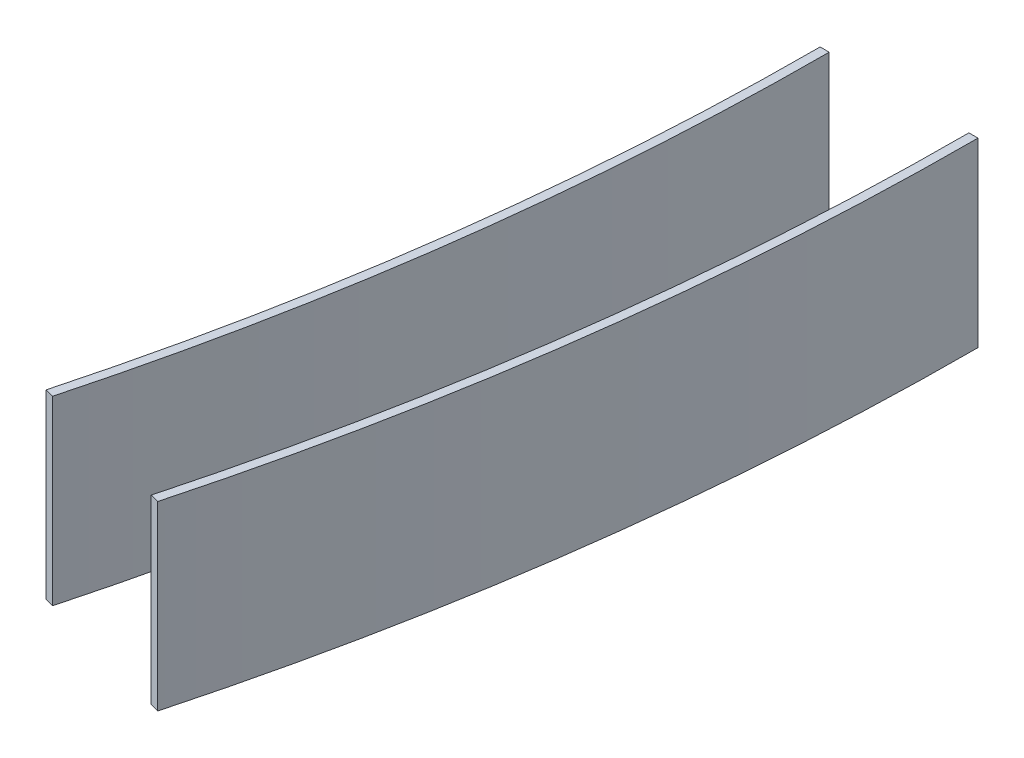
ISO-10303-21;
HEADER;
FILE_DESCRIPTION(('STEP AP214'),'2;1');
FILE_NAME('part.step','',(''),(''),'','','');
FILE_SCHEMA(('AUTOMOTIVE_DESIGN { 1 0 10303 214 1 1 1 1 }'));
ENDSEC;
DATA;
#1=APPLICATION_CONTEXT('core data for automotive mechanical design processes');
#2=APPLICATION_PROTOCOL_DEFINITION('international standard','automotive_design',2000,#1);
#3=PRODUCT_CONTEXT('',#1,'mechanical');
#4=PRODUCT('Part','Part','',(#3));
#5=PRODUCT_RELATED_PRODUCT_CATEGORY('part','',(#4));
#6=PRODUCT_DEFINITION_FORMATION('','',#4);
#7=PRODUCT_DEFINITION_CONTEXT('part definition',#1,'design');
#8=PRODUCT_DEFINITION('design','',#6,#7);
#9=PRODUCT_DEFINITION_SHAPE('','',#8);
#10=(LENGTH_UNIT() NAMED_UNIT(*) SI_UNIT(.MILLI.,.METRE.));
#11=(NAMED_UNIT(*) PLANE_ANGLE_UNIT() SI_UNIT($,.RADIAN.));
#12=(NAMED_UNIT(*) SI_UNIT($,.STERADIAN.) SOLID_ANGLE_UNIT());
#13=UNCERTAINTY_MEASURE_WITH_UNIT(LENGTH_MEASURE(1.E-05),#10,'distance_accuracy_value','');
#14=(GEOMETRIC_REPRESENTATION_CONTEXT(3) GLOBAL_UNCERTAINTY_ASSIGNED_CONTEXT((#13)) GLOBAL_UNIT_ASSIGNED_CONTEXT((#10,
#11,#12)) REPRESENTATION_CONTEXT('',''));
#15=CARTESIAN_POINT('',(0.,0.,0.));
#16=DIRECTION('',(0.,0.,1.));
#17=DIRECTION('',(1.,0.,0.));
#18=AXIS2_PLACEMENT_3D('',#15,#16,#17);
#19=CARTESIAN_POINT('',(0.,-9.74999999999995,0.));
#20=DIRECTION('',(0.,-1.,0.));
#21=DIRECTION('',(0.,0.,-1.));
#22=AXIS2_PLACEMENT_3D('',#19,#20,#21);
#23=PLANE('',#22);
#24=CARTESIAN_POINT('',(0.,-9.74999999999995,0.));
#25=DIRECTION('',(0.,1.,0.));
#26=DIRECTION('',(0.,0.,1.));
#27=AXIS2_PLACEMENT_3D('',#24,#25,#26);
#28=CIRCLE('',#27,154.35);
#29=CARTESIAN_POINT('',(149.090651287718,-9.74999999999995,39.9487196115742));
#30=VERTEX_POINT('',#29);
#31=CARTESIAN_POINT('',(154.35,-9.74999999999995,0.));
#32=VERTEX_POINT('',#31);
#33=EDGE_CURVE('E12',#30,#32,#28,.T.);
#34=ORIENTED_EDGE('',*,*,#33,.F.);
#35=DIRECTION('',(-0.965925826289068,0.,-0.258819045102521));
#36=VECTOR('',#35,1.);
#37=CARTESIAN_POINT('',(0.,-9.74999999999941,0.));
#38=LINE('',#37,#36);
#39=CARTESIAN_POINT('',(148.607688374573,-9.74999999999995,39.8193100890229));
#40=VERTEX_POINT('',#39);
#41=EDGE_CURVE('E108',#30,#40,#38,.T.);
#42=ORIENTED_EDGE('',*,*,#41,.T.);
#43=CARTESIAN_POINT('',(0.,-9.74999999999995,0.));
#44=DIRECTION('',(0.,1.,0.));
#45=DIRECTION('',(0.,0.,1.));
#46=AXIS2_PLACEMENT_3D('',#43,#44,#45);
#47=CIRCLE('',#46,153.85);
#48=CARTESIAN_POINT('',(153.85,-9.74999999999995,0.));
#49=VERTEX_POINT('',#48);
#50=EDGE_CURVE('E61',#40,#49,#47,.T.);
#51=ORIENTED_EDGE('',*,*,#50,.T.);
#52=DIRECTION('',(-1.,0.,0.));
#53=VECTOR('',#52,1.);
#54=CARTESIAN_POINT('',(0.,-9.74999999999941,0.));
#55=LINE('',#54,#53);
#56=EDGE_CURVE('E97',#32,#49,#55,.T.);
#57=ORIENTED_EDGE('',*,*,#56,.F.);
#58=EDGE_LOOP('',(#34,#42,#51,#57));
#59=FACE_BOUND('',#58,.T.);
#60=ADVANCED_FACE('F46',(#59),#23,.T.);
#61=CARTESIAN_POINT('',(0.,44.1101666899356,0.));
#62=DIRECTION('',(0.,1.,0.));
#63=DIRECTION('',(0.,0.,1.));
#64=AXIS2_PLACEMENT_3D('',#61,#62,#63);
#65=CYLINDRICAL_SURFACE('',#64,154.35);
#66=CARTESIAN_POINT('',(0.,0.250000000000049,0.));
#67=DIRECTION('',(0.,1.,0.));
#68=DIRECTION('',(0.,0.,1.));
#69=AXIS2_PLACEMENT_3D('',#66,#67,#68);
#70=CIRCLE('',#69,154.35);
#71=CARTESIAN_POINT('',(149.090651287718,0.250000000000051,39.9487196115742));
#72=VERTEX_POINT('',#71);
#73=CARTESIAN_POINT('',(154.35,0.250000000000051,0.));
#74=VERTEX_POINT('',#73);
#75=EDGE_CURVE('E54',#72,#74,#70,.T.);
#76=ORIENTED_EDGE('',*,*,#75,.F.);
#77=DIRECTION('',(0.,1.,0.));
#78=VECTOR('',#77,1.);
#79=CARTESIAN_POINT('',(149.090651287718,0.,39.9487196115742));
#80=LINE('',#79,#78);
#81=EDGE_CURVE('E93',#30,#72,#80,.T.);
#82=ORIENTED_EDGE('',*,*,#81,.F.);
#83=ORIENTED_EDGE('',*,*,#33,.T.);
#84=DIRECTION('',(0.,1.,0.));
#85=VECTOR('',#84,1.);
#86=CARTESIAN_POINT('',(154.35,0.,0.));
#87=LINE('',#86,#85);
#88=EDGE_CURVE('E90',#32,#74,#87,.T.);
#89=ORIENTED_EDGE('',*,*,#88,.T.);
#90=EDGE_LOOP('',(#76,#82,#83,#89));
#91=FACE_BOUND('',#90,.T.);
#92=ADVANCED_FACE('F48',(#91),#65,.T.);
#93=CARTESIAN_POINT('',(0.,0.250000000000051,0.));
#94=DIRECTION('',(0.,1.,0.));
#95=DIRECTION('',(0.,0.,1.));
#96=AXIS2_PLACEMENT_3D('',#93,#94,#95);
#97=PLANE('',#96);
#98=CARTESIAN_POINT('',(0.,0.250000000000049,0.));
#99=DIRECTION('',(0.,1.,0.));
#100=DIRECTION('',(0.,0.,1.));
#101=AXIS2_PLACEMENT_3D('',#98,#99,#100);
#102=CIRCLE('',#101,153.85);
#103=CARTESIAN_POINT('',(148.607688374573,0.250000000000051,39.8193100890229));
#104=VERTEX_POINT('',#103);
#105=CARTESIAN_POINT('',(153.85,0.250000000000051,0.));
#106=VERTEX_POINT('',#105);
#107=EDGE_CURVE('E69',#104,#106,#102,.T.);
#108=ORIENTED_EDGE('',*,*,#107,.F.);
#109=DIRECTION('',(0.965925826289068,0.,0.258819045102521));
#110=VECTOR('',#109,1.);
#111=CARTESIAN_POINT('',(0.,0.250000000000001,0.));
#112=LINE('',#111,#110);
#113=EDGE_CURVE('E111',#104,#72,#112,.T.);
#114=ORIENTED_EDGE('',*,*,#113,.T.);
#115=ORIENTED_EDGE('',*,*,#75,.T.);
#116=DIRECTION('',(1.,0.,0.));
#117=VECTOR('',#116,1.);
#118=CARTESIAN_POINT('',(0.,0.250000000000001,0.));
#119=LINE('',#118,#117);
#120=EDGE_CURVE('E102',#106,#74,#119,.T.);
#121=ORIENTED_EDGE('',*,*,#120,.F.);
#122=EDGE_LOOP('',(#108,#114,#115,#121));
#123=FACE_BOUND('',#122,.T.);
#124=ADVANCED_FACE('F117',(#123),#97,.T.);
#125=CARTESIAN_POINT('',(0.,44.1101666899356,0.));
#126=DIRECTION('',(0.,1.,0.));
#127=DIRECTION('',(0.,0.,1.));
#128=AXIS2_PLACEMENT_3D('',#125,#126,#127);
#129=CYLINDRICAL_SURFACE('',#128,153.85);
#130=DIRECTION('',(0.,-1.,0.));
#131=VECTOR('',#130,1.);
#132=CARTESIAN_POINT('',(148.607688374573,4.27019530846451E-13,39.8193100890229));
#133=LINE('',#132,#131);
#134=EDGE_CURVE('E113',#104,#40,#133,.T.);
#135=ORIENTED_EDGE('',*,*,#134,.F.);
#136=ORIENTED_EDGE('',*,*,#107,.T.);
#137=DIRECTION('',(0.,-1.,0.));
#138=VECTOR('',#137,1.);
#139=CARTESIAN_POINT('',(153.85,4.27019530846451E-13,0.));
#140=LINE('',#139,#138);
#141=EDGE_CURVE('E104',#106,#49,#140,.T.);
#142=ORIENTED_EDGE('',*,*,#141,.T.);
#143=ORIENTED_EDGE('',*,*,#50,.F.);
#144=EDGE_LOOP('',(#135,#136,#142,#143));
#145=FACE_BOUND('',#144,.T.);
#146=ADVANCED_FACE('F120',(#145),#129,.F.);
#147=CARTESIAN_POINT('',(0.,0.,0.));
#148=DIRECTION('',(-0.258819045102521,0.,0.965925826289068));
#149=DIRECTION('',(0.965925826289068,0.,0.258819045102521));
#150=AXIS2_PLACEMENT_3D('',#147,#148,#149);
#151=PLANE('',#150);
#152=ORIENTED_EDGE('',*,*,#41,.F.);
#153=ORIENTED_EDGE('',*,*,#81,.T.);
#154=ORIENTED_EDGE('',*,*,#113,.F.);
#155=ORIENTED_EDGE('',*,*,#134,.T.);
#156=EDGE_LOOP('',(#152,#153,#154,#155));
#157=FACE_BOUND('',#156,.T.);
#158=ADVANCED_FACE('F119',(#157),#151,.T.);
#159=CARTESIAN_POINT('',(0.,0.,0.));
#160=DIRECTION('',(0.,0.,1.));
#161=DIRECTION('',(1.,0.,0.));
#162=AXIS2_PLACEMENT_3D('',#159,#160,#161);
#163=PLANE('',#162);
#164=ORIENTED_EDGE('',*,*,#56,.T.);
#165=ORIENTED_EDGE('',*,*,#141,.F.);
#166=ORIENTED_EDGE('',*,*,#120,.T.);
#167=ORIENTED_EDGE('',*,*,#88,.F.);
#168=EDGE_LOOP('',(#164,#165,#166,#167));
#169=FACE_BOUND('',#168,.T.);
#170=ADVANCED_FACE('F101',(#169),#163,.F.);
#171=CLOSED_SHELL('',(#60,#92,#124,#146,#158,#170));
#172=MANIFOLD_SOLID_BREP('B2',#171);
#173=CARTESIAN_POINT('',(0.,-9.74999999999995,0.));
#174=DIRECTION('',(0.,-1.,0.));
#175=DIRECTION('',(0.,0.,-1.));
#176=AXIS2_PLACEMENT_3D('',#173,#174,#175);
#177=PLANE('',#176);
#178=CARTESIAN_POINT('',(0.,-9.74999999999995,0.));
#179=DIRECTION('',(0.,1.,0.));
#180=DIRECTION('',(0.,0.,1.));
#181=AXIS2_PLACEMENT_3D('',#178,#179,#180);
#182=CIRCLE('',#181,146.15);
#183=CARTESIAN_POINT('',(141.170059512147,-9.74999999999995,37.8264034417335));
#184=VERTEX_POINT('',#183);
#185=CARTESIAN_POINT('',(146.15,-9.74999999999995,0.));
#186=VERTEX_POINT('',#185);
#187=EDGE_CURVE('E44',#184,#186,#182,.T.);
#188=ORIENTED_EDGE('',*,*,#187,.F.);
#189=DIRECTION('',(-0.965925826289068,0.,-0.258819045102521));
#190=VECTOR('',#189,1.);
#191=CARTESIAN_POINT('',(0.,-9.75000000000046,0.));
#192=LINE('',#191,#190);
#193=CARTESIAN_POINT('',(140.687096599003,-9.74999999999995,37.6969939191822));
#194=VERTEX_POINT('',#193);
#195=EDGE_CURVE('E234',#184,#194,#192,.T.);
#196=ORIENTED_EDGE('',*,*,#195,.T.);
#197=CARTESIAN_POINT('',(0.,-9.74999999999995,0.));
#198=DIRECTION('',(0.,1.,0.));
#199=DIRECTION('',(0.,0.,1.));
#200=AXIS2_PLACEMENT_3D('',#197,#198,#199);
#201=CIRCLE('',#200,145.65);
#202=CARTESIAN_POINT('',(145.65,-9.74999999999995,0.));
#203=VERTEX_POINT('',#202);
#204=EDGE_CURVE('E187',#194,#203,#201,.T.);
#205=ORIENTED_EDGE('',*,*,#204,.T.);
#206=DIRECTION('',(-1.,0.,0.));
#207=VECTOR('',#206,1.);
#208=CARTESIAN_POINT('',(0.,-9.75000000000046,0.));
#209=LINE('',#208,#207);
#210=EDGE_CURVE('E223',#186,#203,#209,.T.);
#211=ORIENTED_EDGE('',*,*,#210,.F.);
#212=EDGE_LOOP('',(#188,#196,#205,#211));
#213=FACE_BOUND('',#212,.T.);
#214=ADVANCED_FACE('F172',(#213),#177,.T.);
#215=CARTESIAN_POINT('',(0.,44.1101666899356,0.));
#216=DIRECTION('',(0.,1.,0.));
#217=DIRECTION('',(0.,0.,1.));
#218=AXIS2_PLACEMENT_3D('',#215,#216,#217);
#219=CYLINDRICAL_SURFACE('',#218,146.15);
#220=CARTESIAN_POINT('',(0.,0.250000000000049,0.));
#221=DIRECTION('',(0.,1.,0.));
#222=DIRECTION('',(0.,0.,1.));
#223=AXIS2_PLACEMENT_3D('',#220,#221,#222);
#224=CIRCLE('',#223,146.15);
#225=CARTESIAN_POINT('',(141.170059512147,0.25000000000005,37.8264034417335));
#226=VERTEX_POINT('',#225);
#227=CARTESIAN_POINT('',(146.15,0.25000000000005,0.));
#228=VERTEX_POINT('',#227);
#229=EDGE_CURVE('E180',#226,#228,#224,.T.);
#230=ORIENTED_EDGE('',*,*,#229,.F.);
#231=DIRECTION('',(0.,-1.,0.));
#232=VECTOR('',#231,1.);
#233=CARTESIAN_POINT('',(141.170059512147,-4.05647737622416E-13,37.8264034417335));
#234=LINE('',#233,#232);
#235=EDGE_CURVE('E219',#226,#184,#234,.T.);
#236=ORIENTED_EDGE('',*,*,#235,.T.);
#237=ORIENTED_EDGE('',*,*,#187,.T.);
#238=DIRECTION('',(0.,-1.,0.));
#239=VECTOR('',#238,1.);
#240=CARTESIAN_POINT('',(146.15,-4.05647737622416E-13,0.));
#241=LINE('',#240,#239);
#242=EDGE_CURVE('E216',#228,#186,#241,.T.);
#243=ORIENTED_EDGE('',*,*,#242,.F.);
#244=EDGE_LOOP('',(#230,#236,#237,#243));
#245=FACE_BOUND('',#244,.T.);
#246=ADVANCED_FACE('F174',(#245),#219,.T.);
#247=CARTESIAN_POINT('',(0.,0.25000000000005,0.));
#248=DIRECTION('',(0.,1.,0.));
#249=DIRECTION('',(0.,0.,1.));
#250=AXIS2_PLACEMENT_3D('',#247,#248,#249);
#251=PLANE('',#250);
#252=CARTESIAN_POINT('',(0.,0.250000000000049,0.));
#253=DIRECTION('',(0.,1.,0.));
#254=DIRECTION('',(0.,0.,1.));
#255=AXIS2_PLACEMENT_3D('',#252,#253,#254);
#256=CIRCLE('',#255,145.65);
#257=CARTESIAN_POINT('',(140.687096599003,0.25000000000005,37.6969939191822));
#258=VERTEX_POINT('',#257);
#259=CARTESIAN_POINT('',(145.65,0.25000000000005,0.));
#260=VERTEX_POINT('',#259);
#261=EDGE_CURVE('E195',#258,#260,#256,.T.);
#262=ORIENTED_EDGE('',*,*,#261,.F.);
#263=DIRECTION('',(0.965925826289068,0.,0.258819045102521));
#264=VECTOR('',#263,1.);
#265=CARTESIAN_POINT('',(0.,0.25000000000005,0.));
#266=LINE('',#265,#264);
#267=EDGE_CURVE('E237',#258,#226,#266,.T.);
#268=ORIENTED_EDGE('',*,*,#267,.T.);
#269=ORIENTED_EDGE('',*,*,#229,.T.);
#270=DIRECTION('',(1.,0.,0.));
#271=VECTOR('',#270,1.);
#272=CARTESIAN_POINT('',(0.,0.25000000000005,0.));
#273=LINE('',#272,#271);
#274=EDGE_CURVE('E228',#260,#228,#273,.T.);
#275=ORIENTED_EDGE('',*,*,#274,.F.);
#276=EDGE_LOOP('',(#262,#268,#269,#275));
#277=FACE_BOUND('',#276,.T.);
#278=ADVANCED_FACE('F243',(#277),#251,.T.);
#279=CARTESIAN_POINT('',(0.,44.1101666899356,0.));
#280=DIRECTION('',(0.,1.,0.));
#281=DIRECTION('',(0.,0.,1.));
#282=AXIS2_PLACEMENT_3D('',#279,#280,#281);
#283=CYLINDRICAL_SURFACE('',#282,145.65);
#284=DIRECTION('',(0.,-1.,0.));
#285=VECTOR('',#284,1.);
#286=CARTESIAN_POINT('',(140.687096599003,0.,37.6969939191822));
#287=LINE('',#286,#285);
#288=EDGE_CURVE('E239',#258,#194,#287,.T.);
#289=ORIENTED_EDGE('',*,*,#288,.F.);
#290=ORIENTED_EDGE('',*,*,#261,.T.);
#291=DIRECTION('',(0.,-1.,0.));
#292=VECTOR('',#291,1.);
#293=CARTESIAN_POINT('',(145.65,0.,0.));
#294=LINE('',#293,#292);
#295=EDGE_CURVE('E230',#260,#203,#294,.T.);
#296=ORIENTED_EDGE('',*,*,#295,.T.);
#297=ORIENTED_EDGE('',*,*,#204,.F.);
#298=EDGE_LOOP('',(#289,#290,#296,#297));
#299=FACE_BOUND('',#298,.T.);
#300=ADVANCED_FACE('F246',(#299),#283,.F.);
#301=CARTESIAN_POINT('',(0.,0.,0.));
#302=DIRECTION('',(-0.258819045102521,0.,0.965925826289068));
#303=DIRECTION('',(0.965925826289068,0.,0.258819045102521));
#304=AXIS2_PLACEMENT_3D('',#301,#302,#303);
#305=PLANE('',#304);
#306=ORIENTED_EDGE('',*,*,#195,.F.);
#307=ORIENTED_EDGE('',*,*,#235,.F.);
#308=ORIENTED_EDGE('',*,*,#267,.F.);
#309=ORIENTED_EDGE('',*,*,#288,.T.);
#310=EDGE_LOOP('',(#306,#307,#308,#309));
#311=FACE_BOUND('',#310,.T.);
#312=ADVANCED_FACE('F245',(#311),#305,.T.);
#313=CARTESIAN_POINT('',(0.,0.,0.));
#314=DIRECTION('',(0.,0.,1.));
#315=DIRECTION('',(1.,0.,0.));
#316=AXIS2_PLACEMENT_3D('',#313,#314,#315);
#317=PLANE('',#316);
#318=ORIENTED_EDGE('',*,*,#210,.T.);
#319=ORIENTED_EDGE('',*,*,#295,.F.);
#320=ORIENTED_EDGE('',*,*,#274,.T.);
#321=ORIENTED_EDGE('',*,*,#242,.T.);
#322=EDGE_LOOP('',(#318,#319,#320,#321));
#323=FACE_BOUND('',#322,.T.);
#324=ADVANCED_FACE('F227',(#323),#317,.F.);
#325=CLOSED_SHELL('',(#214,#246,#278,#300,#312,#324));
#326=MANIFOLD_SOLID_BREP('B6',#325);
#327=ADVANCED_BREP_SHAPE_REPRESENTATION('',(#18,#172,#326),#14);
#328=SHAPE_DEFINITION_REPRESENTATION(#9,#327);
ENDSEC;
END-ISO-10303-21;
